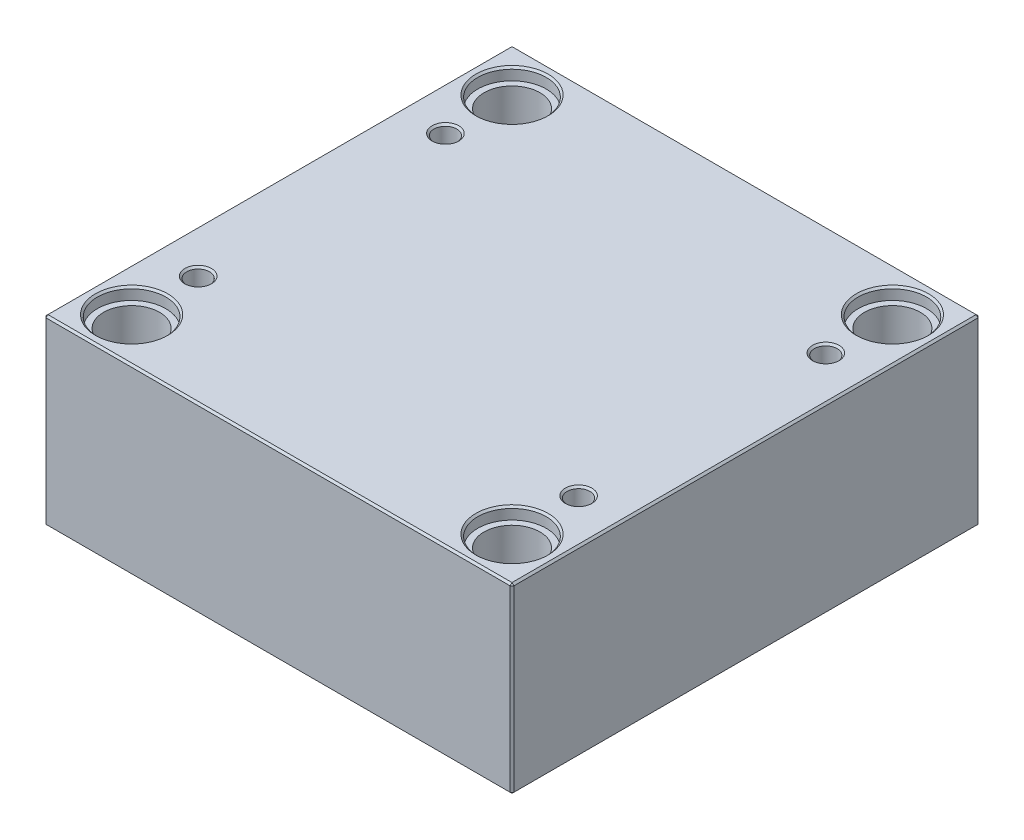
ISO-10303-21;
HEADER;
FILE_DESCRIPTION(('STEP AP214'),'2;1');
FILE_NAME('part.step','',(''),(''),'','','');
FILE_SCHEMA(('AUTOMOTIVE_DESIGN { 1 0 10303 214 1 1 1 1 }'));
ENDSEC;
DATA;
#1=APPLICATION_CONTEXT('core data for automotive mechanical design processes');
#2=APPLICATION_PROTOCOL_DEFINITION('international standard','automotive_design',2000,#1);
#3=PRODUCT_CONTEXT('',#1,'mechanical');
#4=PRODUCT('Part','Part','',(#3));
#5=PRODUCT_RELATED_PRODUCT_CATEGORY('part','',(#4));
#6=PRODUCT_DEFINITION_FORMATION('','',#4);
#7=PRODUCT_DEFINITION_CONTEXT('part definition',#1,'design');
#8=PRODUCT_DEFINITION('design','',#6,#7);
#9=PRODUCT_DEFINITION_SHAPE('','',#8);
#10=(LENGTH_UNIT() NAMED_UNIT(*) SI_UNIT(.MILLI.,.METRE.));
#11=(NAMED_UNIT(*) PLANE_ANGLE_UNIT() SI_UNIT($,.RADIAN.));
#12=(NAMED_UNIT(*) SI_UNIT($,.STERADIAN.) SOLID_ANGLE_UNIT());
#13=UNCERTAINTY_MEASURE_WITH_UNIT(LENGTH_MEASURE(1.E-05),#10,'distance_accuracy_value','');
#14=(GEOMETRIC_REPRESENTATION_CONTEXT(3) GLOBAL_UNCERTAINTY_ASSIGNED_CONTEXT((#13)) GLOBAL_UNIT_ASSIGNED_CONTEXT((#10,
#11,#12)) REPRESENTATION_CONTEXT('',''));
#15=CARTESIAN_POINT('',(0.,0.,0.));
#16=DIRECTION('',(0.,0.,1.));
#17=DIRECTION('',(1.,0.,0.));
#18=AXIS2_PLACEMENT_3D('',#15,#16,#17);
#19=CARTESIAN_POINT('',(-100.,0.,-100.));
#20=DIRECTION('',(0.,1.,0.));
#21=DIRECTION('',(0.,0.,1.));
#22=AXIS2_PLACEMENT_3D('',#19,#20,#21);
#23=CYLINDRICAL_SURFACE('',#22,14.7);
#24=CARTESIAN_POINT('',(-100.,0.999999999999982,-100.));
#25=DIRECTION('',(0.,1.,0.));
#26=DIRECTION('',(0.,0.,1.));
#27=AXIS2_PLACEMENT_3D('',#24,#25,#26);
#28=CIRCLE('',#27,14.7);
#29=CARTESIAN_POINT('',(-100.,0.999999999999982,-85.3));
#30=VERTEX_POINT('',#29);
#31=EDGE_CURVE('E472',#30,#30,#28,.F.);
#32=ORIENTED_EDGE('',*,*,#31,.T.);
#33=EDGE_LOOP('',(#32));
#34=FACE_BOUND('',#33,.T.);
#35=CARTESIAN_POINT('',(-100.,89.7,-100.));
#36=DIRECTION('',(0.,1.,0.));
#37=DIRECTION('',(0.,0.,1.));
#38=AXIS2_PLACEMENT_3D('',#35,#36,#37);
#39=CIRCLE('',#38,14.7);
#40=CARTESIAN_POINT('',(-100.,89.7,-85.3));
#41=VERTEX_POINT('',#40);
#42=EDGE_CURVE('E221',#41,#41,#39,.F.);
#43=ORIENTED_EDGE('',*,*,#42,.F.);
#44=EDGE_LOOP('',(#43));
#45=FACE_BOUND('',#44,.T.);
#46=ADVANCED_FACE('F16',(#34,#45),#23,.F.);
#47=CARTESIAN_POINT('',(100.,0.,-100.));
#48=DIRECTION('',(0.,1.,0.));
#49=DIRECTION('',(0.,0.,1.));
#50=AXIS2_PLACEMENT_3D('',#47,#48,#49);
#51=CYLINDRICAL_SURFACE('',#50,14.7);
#52=CARTESIAN_POINT('',(100.,0.999999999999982,-100.));
#53=DIRECTION('',(0.,1.,0.));
#54=DIRECTION('',(0.,0.,1.));
#55=AXIS2_PLACEMENT_3D('',#52,#53,#54);
#56=CIRCLE('',#55,14.7);
#57=CARTESIAN_POINT('',(100.,0.999999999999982,-85.3));
#58=VERTEX_POINT('',#57);
#59=EDGE_CURVE('E474',#58,#58,#56,.F.);
#60=ORIENTED_EDGE('',*,*,#59,.T.);
#61=EDGE_LOOP('',(#60));
#62=FACE_BOUND('',#61,.T.);
#63=CARTESIAN_POINT('',(100.,89.7,-100.));
#64=DIRECTION('',(0.,1.,0.));
#65=DIRECTION('',(0.,0.,1.));
#66=AXIS2_PLACEMENT_3D('',#63,#64,#65);
#67=CIRCLE('',#66,14.7);
#68=CARTESIAN_POINT('',(100.,89.7,-85.3));
#69=VERTEX_POINT('',#68);
#70=EDGE_CURVE('E218',#69,#69,#67,.F.);
#71=ORIENTED_EDGE('',*,*,#70,.F.);
#72=EDGE_LOOP('',(#71));
#73=FACE_BOUND('',#72,.T.);
#74=ADVANCED_FACE('F263',(#62,#73),#51,.F.);
#75=CARTESIAN_POINT('',(100.,0.,100.));
#76=DIRECTION('',(0.,1.,0.));
#77=DIRECTION('',(0.,0.,1.));
#78=AXIS2_PLACEMENT_3D('',#75,#76,#77);
#79=CYLINDRICAL_SURFACE('',#78,14.7);
#80=CARTESIAN_POINT('',(100.,1.00000000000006,100.));
#81=DIRECTION('',(0.,1.,0.));
#82=DIRECTION('',(0.,0.,1.));
#83=AXIS2_PLACEMENT_3D('',#80,#81,#82);
#84=CIRCLE('',#83,14.7);
#85=CARTESIAN_POINT('',(100.,1.00000000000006,114.7));
#86=VERTEX_POINT('',#85);
#87=EDGE_CURVE('E477',#86,#86,#84,.F.);
#88=ORIENTED_EDGE('',*,*,#87,.T.);
#89=EDGE_LOOP('',(#88));
#90=FACE_BOUND('',#89,.T.);
#91=CARTESIAN_POINT('',(100.,89.7,100.));
#92=DIRECTION('',(0.,1.,0.));
#93=DIRECTION('',(0.,0.,1.));
#94=AXIS2_PLACEMENT_3D('',#91,#92,#93);
#95=CIRCLE('',#94,14.7);
#96=CARTESIAN_POINT('',(100.,89.7,114.7));
#97=VERTEX_POINT('',#96);
#98=EDGE_CURVE('E214',#97,#97,#95,.F.);
#99=ORIENTED_EDGE('',*,*,#98,.F.);
#100=EDGE_LOOP('',(#99));
#101=FACE_BOUND('',#100,.T.);
#102=ADVANCED_FACE('F270',(#90,#101),#79,.F.);
#103=CARTESIAN_POINT('',(-100.,0.,100.));
#104=DIRECTION('',(0.,1.,0.));
#105=DIRECTION('',(0.,0.,1.));
#106=AXIS2_PLACEMENT_3D('',#103,#104,#105);
#107=CYLINDRICAL_SURFACE('',#106,14.7);
#108=CARTESIAN_POINT('',(-100.,1.00000000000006,100.));
#109=DIRECTION('',(0.,1.,0.));
#110=DIRECTION('',(0.,0.,1.));
#111=AXIS2_PLACEMENT_3D('',#108,#109,#110);
#112=CIRCLE('',#111,14.7);
#113=CARTESIAN_POINT('',(-100.,1.00000000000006,114.7));
#114=VERTEX_POINT('',#113);
#115=EDGE_CURVE('E480',#114,#114,#112,.F.);
#116=ORIENTED_EDGE('',*,*,#115,.T.);
#117=EDGE_LOOP('',(#116));
#118=FACE_BOUND('',#117,.T.);
#119=CARTESIAN_POINT('',(-100.,89.7,100.));
#120=DIRECTION('',(0.,1.,0.));
#121=DIRECTION('',(0.,0.,1.));
#122=AXIS2_PLACEMENT_3D('',#119,#120,#121);
#123=CIRCLE('',#122,14.7);
#124=CARTESIAN_POINT('',(-100.,89.7,114.7));
#125=VERTEX_POINT('',#124);
#126=EDGE_CURVE('E211',#125,#125,#123,.F.);
#127=ORIENTED_EDGE('',*,*,#126,.F.);
#128=EDGE_LOOP('',(#127));
#129=FACE_BOUND('',#128,.T.);
#130=ADVANCED_FACE('F277',(#118,#129),#107,.F.);
#131=CARTESIAN_POINT('',(-123.,96.,123.));
#132=DIRECTION('',(1.,0.,0.));
#133=DIRECTION('',(0.,0.,-1.));
#134=AXIS2_PLACEMENT_3D('',#131,#132,#133);
#135=PLANE('',#134);
#136=DIRECTION('',(0.,-1.,0.));
#137=VECTOR('',#136,1.);
#138=CARTESIAN_POINT('',(-123.,96.,-122.));
#139=LINE('',#138,#137);
#140=CARTESIAN_POINT('',(-123.,95.,-122.));
#141=VERTEX_POINT('',#140);
#142=CARTESIAN_POINT('',(-123.,1.,-122.));
#143=VERTEX_POINT('',#142);
#144=EDGE_CURVE('E487',#141,#143,#139,.T.);
#145=ORIENTED_EDGE('',*,*,#144,.T.);
#146=DIRECTION('',(0.,0.,1.));
#147=VECTOR('',#146,1.);
#148=CARTESIAN_POINT('',(-123.,1.,123.));
#149=LINE('',#148,#147);
#150=CARTESIAN_POINT('',(-123.,1.,122.));
#151=VERTEX_POINT('',#150);
#152=EDGE_CURVE('E490',#143,#151,#149,.T.);
#153=ORIENTED_EDGE('',*,*,#152,.T.);
#154=DIRECTION('',(0.,1.,0.));
#155=VECTOR('',#154,1.);
#156=CARTESIAN_POINT('',(-123.,96.,122.));
#157=LINE('',#156,#155);
#158=CARTESIAN_POINT('',(-123.,95.,122.));
#159=VERTEX_POINT('',#158);
#160=EDGE_CURVE('E485',#151,#159,#157,.T.);
#161=ORIENTED_EDGE('',*,*,#160,.T.);
#162=DIRECTION('',(0.,0.,-1.));
#163=VECTOR('',#162,1.);
#164=CARTESIAN_POINT('',(-123.,95.,-123.));
#165=LINE('',#164,#163);
#166=EDGE_CURVE('E483',#159,#141,#165,.T.);
#167=ORIENTED_EDGE('',*,*,#166,.T.);
#168=EDGE_LOOP('',(#145,#153,#161,#167));
#169=FACE_BOUND('',#168,.T.);
#170=ADVANCED_FACE('F298',(#169),#135,.F.);
#171=CARTESIAN_POINT('',(123.,96.,123.));
#172=DIRECTION('',(0.,0.,-1.));
#173=DIRECTION('',(-1.,0.,0.));
#174=AXIS2_PLACEMENT_3D('',#171,#172,#173);
#175=PLANE('',#174);
#176=DIRECTION('',(-1.,0.,0.));
#177=VECTOR('',#176,1.);
#178=CARTESIAN_POINT('',(-123.,95.,123.));
#179=LINE('',#178,#177);
#180=CARTESIAN_POINT('',(122.,95.,123.));
#181=VERTEX_POINT('',#180);
#182=CARTESIAN_POINT('',(-122.,95.,123.));
#183=VERTEX_POINT('',#182);
#184=EDGE_CURVE('E509',#181,#183,#179,.T.);
#185=ORIENTED_EDGE('',*,*,#184,.T.);
#186=DIRECTION('',(0.,-1.,0.));
#187=VECTOR('',#186,1.);
#188=CARTESIAN_POINT('',(-122.,96.,123.));
#189=LINE('',#188,#187);
#190=CARTESIAN_POINT('',(-122.,1.,123.));
#191=VERTEX_POINT('',#190);
#192=EDGE_CURVE('E515',#183,#191,#189,.T.);
#193=ORIENTED_EDGE('',*,*,#192,.T.);
#194=DIRECTION('',(1.,0.,0.));
#195=VECTOR('',#194,1.);
#196=CARTESIAN_POINT('',(123.,1.,123.));
#197=LINE('',#196,#195);
#198=CARTESIAN_POINT('',(122.,1.,123.));
#199=VERTEX_POINT('',#198);
#200=EDGE_CURVE('E513',#191,#199,#197,.T.);
#201=ORIENTED_EDGE('',*,*,#200,.T.);
#202=DIRECTION('',(0.,1.,0.));
#203=VECTOR('',#202,1.);
#204=CARTESIAN_POINT('',(122.,96.,123.));
#205=LINE('',#204,#203);
#206=EDGE_CURVE('E511',#199,#181,#205,.T.);
#207=ORIENTED_EDGE('',*,*,#206,.T.);
#208=EDGE_LOOP('',(#185,#193,#201,#207));
#209=FACE_BOUND('',#208,.T.);
#210=ADVANCED_FACE('F294',(#209),#175,.F.);
#211=CARTESIAN_POINT('',(123.,96.,123.));
#212=DIRECTION('',(-1.,0.,0.));
#213=DIRECTION('',(0.,0.,1.));
#214=AXIS2_PLACEMENT_3D('',#211,#212,#213);
#215=PLANE('',#214);
#216=DIRECTION('',(0.,0.,-1.));
#217=VECTOR('',#216,1.);
#218=CARTESIAN_POINT('',(123.,1.,123.));
#219=LINE('',#218,#217);
#220=CARTESIAN_POINT('',(123.,1.,122.));
#221=VERTEX_POINT('',#220);
#222=CARTESIAN_POINT('',(123.,1.,-122.));
#223=VERTEX_POINT('',#222);
#224=EDGE_CURVE('E504',#221,#223,#219,.T.);
#225=ORIENTED_EDGE('',*,*,#224,.T.);
#226=DIRECTION('',(0.,1.,0.));
#227=VECTOR('',#226,1.);
#228=CARTESIAN_POINT('',(123.,96.,-122.));
#229=LINE('',#228,#227);
#230=CARTESIAN_POINT('',(123.,95.,-122.));
#231=VERTEX_POINT('',#230);
#232=EDGE_CURVE('E506',#223,#231,#229,.T.);
#233=ORIENTED_EDGE('',*,*,#232,.T.);
#234=DIRECTION('',(0.,0.,1.));
#235=VECTOR('',#234,1.);
#236=CARTESIAN_POINT('',(123.,95.,123.));
#237=LINE('',#236,#235);
#238=CARTESIAN_POINT('',(123.,95.,122.));
#239=VERTEX_POINT('',#238);
#240=EDGE_CURVE('E500',#231,#239,#237,.T.);
#241=ORIENTED_EDGE('',*,*,#240,.T.);
#242=DIRECTION('',(0.,-1.,0.));
#243=VECTOR('',#242,1.);
#244=CARTESIAN_POINT('',(123.,96.,122.));
#245=LINE('',#244,#243);
#246=EDGE_CURVE('E502',#239,#221,#245,.T.);
#247=ORIENTED_EDGE('',*,*,#246,.T.);
#248=EDGE_LOOP('',(#225,#233,#241,#247));
#249=FACE_BOUND('',#248,.T.);
#250=ADVANCED_FACE('F290',(#249),#215,.F.);
#251=CARTESIAN_POINT('',(123.,96.,-123.));
#252=DIRECTION('',(0.,0.,1.));
#253=DIRECTION('',(1.,0.,0.));
#254=AXIS2_PLACEMENT_3D('',#251,#252,#253);
#255=PLANE('',#254);
#256=DIRECTION('',(0.,-1.,0.));
#257=VECTOR('',#256,1.);
#258=CARTESIAN_POINT('',(122.,96.,-123.));
#259=LINE('',#258,#257);
#260=CARTESIAN_POINT('',(122.,95.,-123.));
#261=VERTEX_POINT('',#260);
#262=CARTESIAN_POINT('',(122.,1.,-123.));
#263=VERTEX_POINT('',#262);
#264=EDGE_CURVE('E494',#261,#263,#259,.T.);
#265=ORIENTED_EDGE('',*,*,#264,.T.);
#266=DIRECTION('',(-1.,0.,0.));
#267=VECTOR('',#266,1.);
#268=CARTESIAN_POINT('',(123.,1.,-123.));
#269=LINE('',#268,#267);
#270=CARTESIAN_POINT('',(-122.,1.,-123.));
#271=VERTEX_POINT('',#270);
#272=EDGE_CURVE('E138',#263,#271,#269,.T.);
#273=ORIENTED_EDGE('',*,*,#272,.T.);
#274=DIRECTION('',(0.,1.,0.));
#275=VECTOR('',#274,1.);
#276=CARTESIAN_POINT('',(-122.,96.,-123.));
#277=LINE('',#276,#275);
#278=CARTESIAN_POINT('',(-122.,95.,-123.));
#279=VERTEX_POINT('',#278);
#280=EDGE_CURVE('E496',#271,#279,#277,.T.);
#281=ORIENTED_EDGE('',*,*,#280,.T.);
#282=DIRECTION('',(1.,0.,0.));
#283=VECTOR('',#282,1.);
#284=CARTESIAN_POINT('',(123.,95.,-123.));
#285=LINE('',#284,#283);
#286=EDGE_CURVE('E492',#279,#261,#285,.T.);
#287=ORIENTED_EDGE('',*,*,#286,.T.);
#288=EDGE_LOOP('',(#265,#273,#281,#287));
#289=FACE_BOUND('',#288,.T.);
#290=ADVANCED_FACE('F282',(#289),#255,.F.);
#291=CARTESIAN_POINT('',(0.,96.,0.));
#292=DIRECTION('',(0.,1.,0.));
#293=DIRECTION('',(0.,0.,1.));
#294=AXIS2_PLACEMENT_3D('',#291,#292,#293);
#295=PLANE('',#294);
#296=CARTESIAN_POINT('',(100.,96.,100.));
#297=DIRECTION('',(0.,1.,0.));
#298=DIRECTION('',(0.,0.,1.));
#299=AXIS2_PLACEMENT_3D('',#296,#297,#298);
#300=CIRCLE('',#299,19.);
#301=CARTESIAN_POINT('',(100.,96.,119.));
#302=VERTEX_POINT('',#301);
#303=EDGE_CURVE('E236',#302,#302,#300,.F.);
#304=ORIENTED_EDGE('',*,*,#303,.T.);
#305=EDGE_LOOP('',(#304));
#306=FACE_BOUND('',#305,.T.);
#307=CARTESIAN_POINT('',(-100.,96.,100.));
#308=DIRECTION('',(0.,1.,0.));
#309=DIRECTION('',(0.,0.,1.));
#310=AXIS2_PLACEMENT_3D('',#307,#308,#309);
#311=CIRCLE('',#310,19.);
#312=CARTESIAN_POINT('',(-100.,96.,119.));
#313=VERTEX_POINT('',#312);
#314=EDGE_CURVE('E233',#313,#313,#311,.F.);
#315=ORIENTED_EDGE('',*,*,#314,.T.);
#316=EDGE_LOOP('',(#315));
#317=FACE_BOUND('',#316,.T.);
#318=CARTESIAN_POINT('',(100.,96.,-100.));
#319=DIRECTION('',(0.,1.,0.));
#320=DIRECTION('',(0.,0.,1.));
#321=AXIS2_PLACEMENT_3D('',#318,#319,#320);
#322=CIRCLE('',#321,19.);
#323=CARTESIAN_POINT('',(100.,96.,-81.));
#324=VERTEX_POINT('',#323);
#325=EDGE_CURVE('E230',#324,#324,#322,.F.);
#326=ORIENTED_EDGE('',*,*,#325,.T.);
#327=EDGE_LOOP('',(#326));
#328=FACE_BOUND('',#327,.T.);
#329=CARTESIAN_POINT('',(-100.,96.,-100.));
#330=DIRECTION('',(0.,1.,0.));
#331=DIRECTION('',(0.,0.,1.));
#332=AXIS2_PLACEMENT_3D('',#329,#330,#331);
#333=CIRCLE('',#332,19.);
#334=CARTESIAN_POINT('',(-100.,96.,-81.));
#335=VERTEX_POINT('',#334);
#336=EDGE_CURVE('E227',#335,#335,#333,.F.);
#337=ORIENTED_EDGE('',*,*,#336,.T.);
#338=EDGE_LOOP('',(#337));
#339=FACE_BOUND('',#338,.T.);
#340=CARTESIAN_POINT('',(-100.,96.,65.));
#341=DIRECTION('',(0.,1.,0.));
#342=DIRECTION('',(0.,0.,1.));
#343=AXIS2_PLACEMENT_3D('',#340,#341,#342);
#344=CIRCLE('',#343,7.);
#345=CARTESIAN_POINT('',(-100.,96.,72.));
#346=VERTEX_POINT('',#345);
#347=EDGE_CURVE('E198',#346,#346,#344,.F.);
#348=ORIENTED_EDGE('',*,*,#347,.T.);
#349=EDGE_LOOP('',(#348));
#350=FACE_BOUND('',#349,.T.);
#351=CARTESIAN_POINT('',(100.,96.,65.));
#352=DIRECTION('',(0.,1.,0.));
#353=DIRECTION('',(0.,0.,1.));
#354=AXIS2_PLACEMENT_3D('',#351,#352,#353);
#355=CIRCLE('',#354,7.);
#356=CARTESIAN_POINT('',(100.,96.,72.));
#357=VERTEX_POINT('',#356);
#358=EDGE_CURVE('E195',#357,#357,#355,.F.);
#359=ORIENTED_EDGE('',*,*,#358,.T.);
#360=EDGE_LOOP('',(#359));
#361=FACE_BOUND('',#360,.T.);
#362=CARTESIAN_POINT('',(100.,96.,-65.));
#363=DIRECTION('',(0.,1.,0.));
#364=DIRECTION('',(0.,0.,1.));
#365=AXIS2_PLACEMENT_3D('',#362,#363,#364);
#366=CIRCLE('',#365,7.);
#367=CARTESIAN_POINT('',(100.,96.,-58.));
#368=VERTEX_POINT('',#367);
#369=EDGE_CURVE('E192',#368,#368,#366,.F.);
#370=ORIENTED_EDGE('',*,*,#369,.T.);
#371=EDGE_LOOP('',(#370));
#372=FACE_BOUND('',#371,.T.);
#373=CARTESIAN_POINT('',(-100.,96.,-65.));
#374=DIRECTION('',(0.,1.,0.));
#375=DIRECTION('',(0.,0.,1.));
#376=AXIS2_PLACEMENT_3D('',#373,#374,#375);
#377=CIRCLE('',#376,7.);
#378=CARTESIAN_POINT('',(-100.,96.,-58.));
#379=VERTEX_POINT('',#378);
#380=EDGE_CURVE('E188',#379,#379,#377,.F.);
#381=ORIENTED_EDGE('',*,*,#380,.T.);
#382=EDGE_LOOP('',(#381));
#383=FACE_BOUND('',#382,.T.);
#384=DIRECTION('',(0.,0.,-1.));
#385=VECTOR('',#384,1.);
#386=CARTESIAN_POINT('',(122.,96.,-123.));
#387=LINE('',#386,#385);
#388=CARTESIAN_POINT('',(122.,96.,122.));
#389=VERTEX_POINT('',#388);
#390=CARTESIAN_POINT('',(122.,96.,-122.));
#391=VERTEX_POINT('',#390);
#392=EDGE_CURVE('E31',#389,#391,#387,.T.);
#393=ORIENTED_EDGE('',*,*,#392,.T.);
#394=DIRECTION('',(-1.,0.,0.));
#395=VECTOR('',#394,1.);
#396=CARTESIAN_POINT('',(-123.,96.,-122.));
#397=LINE('',#396,#395);
#398=CARTESIAN_POINT('',(-122.,96.,-122.));
#399=VERTEX_POINT('',#398);
#400=EDGE_CURVE('E189',#391,#399,#397,.T.);
#401=ORIENTED_EDGE('',*,*,#400,.T.);
#402=DIRECTION('',(0.,0.,1.));
#403=VECTOR('',#402,1.);
#404=CARTESIAN_POINT('',(-122.,96.,123.));
#405=LINE('',#404,#403);
#406=CARTESIAN_POINT('',(-122.,96.,122.));
#407=VERTEX_POINT('',#406);
#408=EDGE_CURVE('E518',#399,#407,#405,.T.);
#409=ORIENTED_EDGE('',*,*,#408,.T.);
#410=DIRECTION('',(1.,0.,0.));
#411=VECTOR('',#410,1.);
#412=CARTESIAN_POINT('',(123.,96.,122.));
#413=LINE('',#412,#411);
#414=EDGE_CURVE('E36',#407,#389,#413,.T.);
#415=ORIENTED_EDGE('',*,*,#414,.T.);
#416=EDGE_LOOP('',(#393,#401,#409,#415));
#417=FACE_BOUND('',#416,.T.);
#418=ADVANCED_FACE('F279',(#306,#317,#328,#339,#350,#361,#372,#383,#417),#295,.T.);
#419=CARTESIAN_POINT('',(0.,0.,0.));
#420=DIRECTION('',(0.,1.,0.));
#421=DIRECTION('',(0.,0.,1.));
#422=AXIS2_PLACEMENT_3D('',#419,#420,#421);
#423=PLANE('',#422);
#424=CARTESIAN_POINT('',(-100.,0.,-100.));
#425=DIRECTION('',(0.,1.,0.));
#426=DIRECTION('',(0.,0.,1.));
#427=AXIS2_PLACEMENT_3D('',#424,#425,#426);
#428=CIRCLE('',#427,15.7);
#429=CARTESIAN_POINT('',(-100.,0.,-84.3));
#430=VERTEX_POINT('',#429);
#431=EDGE_CURVE('E469',#430,#430,#428,.T.);
#432=ORIENTED_EDGE('',*,*,#431,.T.);
#433=EDGE_LOOP('',(#432));
#434=FACE_BOUND('',#433,.T.);
#435=CARTESIAN_POINT('',(100.,0.,-100.));
#436=DIRECTION('',(0.,1.,0.));
#437=DIRECTION('',(0.,0.,1.));
#438=AXIS2_PLACEMENT_3D('',#435,#436,#437);
#439=CIRCLE('',#438,15.7);
#440=CARTESIAN_POINT('',(100.,0.,-84.3));
#441=VERTEX_POINT('',#440);
#442=EDGE_CURVE('E466',#441,#441,#439,.T.);
#443=ORIENTED_EDGE('',*,*,#442,.T.);
#444=EDGE_LOOP('',(#443));
#445=FACE_BOUND('',#444,.T.);
#446=CARTESIAN_POINT('',(100.,0.,100.));
#447=DIRECTION('',(0.,1.,0.));
#448=DIRECTION('',(0.,0.,1.));
#449=AXIS2_PLACEMENT_3D('',#446,#447,#448);
#450=CIRCLE('',#449,15.7);
#451=CARTESIAN_POINT('',(100.,0.,115.7));
#452=VERTEX_POINT('',#451);
#453=EDGE_CURVE('E463',#452,#452,#450,.T.);
#454=ORIENTED_EDGE('',*,*,#453,.T.);
#455=EDGE_LOOP('',(#454));
#456=FACE_BOUND('',#455,.T.);
#457=CARTESIAN_POINT('',(-100.,0.,100.));
#458=DIRECTION('',(0.,1.,0.));
#459=DIRECTION('',(0.,0.,1.));
#460=AXIS2_PLACEMENT_3D('',#457,#458,#459);
#461=CIRCLE('',#460,15.7);
#462=CARTESIAN_POINT('',(-100.,0.,115.7));
#463=VERTEX_POINT('',#462);
#464=EDGE_CURVE('E460',#463,#463,#461,.T.);
#465=ORIENTED_EDGE('',*,*,#464,.T.);
#466=EDGE_LOOP('',(#465));
#467=FACE_BOUND('',#466,.T.);
#468=DIRECTION('',(0.,0.,1.));
#469=VECTOR('',#468,1.);
#470=CARTESIAN_POINT('',(122.,0.,0.));
#471=LINE('',#470,#469);
#472=CARTESIAN_POINT('',(122.,0.,-122.));
#473=VERTEX_POINT('',#472);
#474=CARTESIAN_POINT('',(122.,0.,122.));
#475=VERTEX_POINT('',#474);
#476=EDGE_CURVE('E108',#473,#475,#471,.T.);
#477=ORIENTED_EDGE('',*,*,#476,.T.);
#478=DIRECTION('',(-1.,0.,0.));
#479=VECTOR('',#478,1.);
#480=CARTESIAN_POINT('',(0.,0.,122.));
#481=LINE('',#480,#479);
#482=CARTESIAN_POINT('',(-122.,0.,122.));
#483=VERTEX_POINT('',#482);
#484=EDGE_CURVE('E458',#475,#483,#481,.T.);
#485=ORIENTED_EDGE('',*,*,#484,.T.);
#486=DIRECTION('',(0.,0.,-1.));
#487=VECTOR('',#486,1.);
#488=CARTESIAN_POINT('',(-122.,0.,0.));
#489=LINE('',#488,#487);
#490=CARTESIAN_POINT('',(-122.,0.,-122.));
#491=VERTEX_POINT('',#490);
#492=EDGE_CURVE('E110',#483,#491,#489,.T.);
#493=ORIENTED_EDGE('',*,*,#492,.T.);
#494=DIRECTION('',(1.,0.,0.));
#495=VECTOR('',#494,1.);
#496=CARTESIAN_POINT('',(0.,0.,-122.));
#497=LINE('',#496,#495);
#498=EDGE_CURVE('E104',#491,#473,#497,.T.);
#499=ORIENTED_EDGE('',*,*,#498,.T.);
#500=EDGE_LOOP('',(#477,#485,#493,#499));
#501=FACE_BOUND('',#500,.T.);
#502=ADVANCED_FACE('F106',(#434,#445,#456,#467,#501),#423,.F.);
#503=CARTESIAN_POINT('',(-100.,0.,-100.));
#504=DIRECTION('',(0.,-1.,0.));
#505=DIRECTION('',(0.,0.,-1.));
#506=AXIS2_PLACEMENT_3D('',#503,#504,#505);
#507=CONICAL_SURFACE('',#506,15.7,0.785398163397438);
#508=ORIENTED_EDGE('',*,*,#31,.F.);
#509=EDGE_LOOP('',(#508));
#510=FACE_BOUND('',#509,.T.);
#511=ORIENTED_EDGE('',*,*,#431,.F.);
#512=EDGE_LOOP('',(#511));
#513=FACE_BOUND('',#512,.T.);
#514=ADVANCED_FACE('F286',(#510,#513),#507,.F.);
#515=CARTESIAN_POINT('',(100.,0.,-100.));
#516=DIRECTION('',(0.,-1.,0.));
#517=DIRECTION('',(0.,0.,-1.));
#518=AXIS2_PLACEMENT_3D('',#515,#516,#517);
#519=CONICAL_SURFACE('',#518,15.7,0.785398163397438);
#520=ORIENTED_EDGE('',*,*,#59,.F.);
#521=EDGE_LOOP('',(#520));
#522=FACE_BOUND('',#521,.T.);
#523=ORIENTED_EDGE('',*,*,#442,.F.);
#524=EDGE_LOOP('',(#523));
#525=FACE_BOUND('',#524,.T.);
#526=ADVANCED_FACE('F305',(#522,#525),#519,.F.);
#527=CARTESIAN_POINT('',(100.,0.,100.));
#528=DIRECTION('',(0.,-1.,0.));
#529=DIRECTION('',(0.,0.,-1.));
#530=AXIS2_PLACEMENT_3D('',#527,#528,#529);
#531=CONICAL_SURFACE('',#530,15.7,0.785398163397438);
#532=ORIENTED_EDGE('',*,*,#87,.F.);
#533=EDGE_LOOP('',(#532));
#534=FACE_BOUND('',#533,.T.);
#535=ORIENTED_EDGE('',*,*,#453,.F.);
#536=EDGE_LOOP('',(#535));
#537=FACE_BOUND('',#536,.T.);
#538=ADVANCED_FACE('F309',(#534,#537),#531,.F.);
#539=CARTESIAN_POINT('',(-100.,0.,100.));
#540=DIRECTION('',(0.,-1.,0.));
#541=DIRECTION('',(0.,0.,-1.));
#542=AXIS2_PLACEMENT_3D('',#539,#540,#541);
#543=CONICAL_SURFACE('',#542,15.7,0.785398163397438);
#544=ORIENTED_EDGE('',*,*,#115,.F.);
#545=EDGE_LOOP('',(#544));
#546=FACE_BOUND('',#545,.T.);
#547=ORIENTED_EDGE('',*,*,#464,.F.);
#548=EDGE_LOOP('',(#547));
#549=FACE_BOUND('',#548,.T.);
#550=ADVANCED_FACE('F313',(#546,#549),#543,.F.);
#551=CARTESIAN_POINT('',(123.,96.,122.));
#552=DIRECTION('',(-0.707106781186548,0.,-0.707106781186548));
#553=DIRECTION('',(0.,-1.,0.));
#554=AXIS2_PLACEMENT_3D('',#551,#552,#553);
#555=PLANE('',#554);
#556=DIRECTION('',(-0.707106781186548,0.,0.707106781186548));
#557=VECTOR('',#556,1.);
#558=CARTESIAN_POINT('',(122.,95.,123.));
#559=LINE('',#558,#557);
#560=EDGE_CURVE('E126',#181,#239,#559,.F.);
#561=ORIENTED_EDGE('',*,*,#560,.F.);
#562=ORIENTED_EDGE('',*,*,#206,.F.);
#563=DIRECTION('',(0.707106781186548,0.,-0.707106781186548));
#564=VECTOR('',#563,1.);
#565=CARTESIAN_POINT('',(122.,1.,123.));
#566=LINE('',#565,#564);
#567=EDGE_CURVE('E180',#221,#199,#566,.F.);
#568=ORIENTED_EDGE('',*,*,#567,.F.);
#569=ORIENTED_EDGE('',*,*,#246,.F.);
#570=EDGE_LOOP('',(#561,#562,#568,#569));
#571=FACE_BOUND('',#570,.T.);
#572=ADVANCED_FACE('F317',(#571),#555,.F.);
#573=CARTESIAN_POINT('',(122.,95.,123.));
#574=DIRECTION('',(0.577350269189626,0.577350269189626,0.577350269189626));
#575=DIRECTION('',(0.707106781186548,0.,-0.707106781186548));
#576=AXIS2_PLACEMENT_3D('',#573,#574,#575);
#577=PLANE('',#576);
#578=DIRECTION('',(0.,-0.70710678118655,0.707106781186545));
#579=VECTOR('',#578,1.);
#580=CARTESIAN_POINT('',(122.,95.,123.));
#581=LINE('',#580,#579);
#582=EDGE_CURVE('E175',#181,#389,#581,.F.);
#583=ORIENTED_EDGE('',*,*,#582,.F.);
#584=ORIENTED_EDGE('',*,*,#560,.T.);
#585=DIRECTION('',(-0.707106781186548,0.707106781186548,0.));
#586=VECTOR('',#585,1.);
#587=CARTESIAN_POINT('',(122.5,95.5,122.));
#588=LINE('',#587,#586);
#589=EDGE_CURVE('E177',#389,#239,#588,.F.);
#590=ORIENTED_EDGE('',*,*,#589,.F.);
#591=EDGE_LOOP('',(#583,#584,#590));
#592=FACE_BOUND('',#591,.T.);
#593=ADVANCED_FACE('F385',(#592),#577,.T.);
#594=CARTESIAN_POINT('',(122.,1.,123.));
#595=DIRECTION('',(0.577350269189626,-0.577350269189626,0.577350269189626));
#596=DIRECTION('',(0.707106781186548,0.,-0.707106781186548));
#597=AXIS2_PLACEMENT_3D('',#594,#595,#596);
#598=PLANE('',#597);
#599=DIRECTION('',(-0.707106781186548,-0.707106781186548,0.));
#600=VECTOR('',#599,1.);
#601=CARTESIAN_POINT('',(122.5,0.5,122.));
#602=LINE('',#601,#600);
#603=EDGE_CURVE('E124',#221,#475,#602,.T.);
#604=ORIENTED_EDGE('',*,*,#603,.F.);
#605=ORIENTED_EDGE('',*,*,#567,.T.);
#606=DIRECTION('',(0.,0.70710678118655,0.707106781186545));
#607=VECTOR('',#606,1.);
#608=CARTESIAN_POINT('',(122.,1.,123.));
#609=LINE('',#608,#607);
#610=EDGE_CURVE('E172',#475,#199,#609,.T.);
#611=ORIENTED_EDGE('',*,*,#610,.F.);
#612=EDGE_LOOP('',(#604,#605,#611));
#613=FACE_BOUND('',#612,.T.);
#614=ADVANCED_FACE('F381',(#613),#598,.T.);
#615=CARTESIAN_POINT('',(122.,96.,0.));
#616=DIRECTION('',(0.707106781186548,0.707106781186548,0.));
#617=DIRECTION('',(0.,0.,1.));
#618=AXIS2_PLACEMENT_3D('',#615,#616,#617);
#619=PLANE('',#618);
#620=ORIENTED_EDGE('',*,*,#589,.T.);
#621=ORIENTED_EDGE('',*,*,#240,.F.);
#622=DIRECTION('',(0.707106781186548,-0.707106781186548,0.));
#623=VECTOR('',#622,1.);
#624=CARTESIAN_POINT('',(123.,95.,-122.));
#625=LINE('',#624,#623);
#626=EDGE_CURVE('E166',#391,#231,#625,.T.);
#627=ORIENTED_EDGE('',*,*,#626,.F.);
#628=ORIENTED_EDGE('',*,*,#392,.F.);
#629=EDGE_LOOP('',(#620,#621,#627,#628));
#630=FACE_BOUND('',#629,.T.);
#631=ADVANCED_FACE('F377',(#630),#619,.T.);
#632=CARTESIAN_POINT('',(0.,96.,122.));
#633=DIRECTION('',(0.,0.707106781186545,0.70710678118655));
#634=DIRECTION('',(-1.,0.,0.));
#635=AXIS2_PLACEMENT_3D('',#632,#633,#634);
#636=PLANE('',#635);
#637=ORIENTED_EDGE('',*,*,#582,.T.);
#638=ORIENTED_EDGE('',*,*,#414,.F.);
#639=DIRECTION('',(0.,0.70710678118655,-0.707106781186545));
#640=VECTOR('',#639,1.);
#641=CARTESIAN_POINT('',(-122.,95.5,122.5));
#642=LINE('',#641,#640);
#643=EDGE_CURVE('E163',#183,#407,#642,.T.);
#644=ORIENTED_EDGE('',*,*,#643,.F.);
#645=ORIENTED_EDGE('',*,*,#184,.F.);
#646=EDGE_LOOP('',(#637,#638,#644,#645));
#647=FACE_BOUND('',#646,.T.);
#648=ADVANCED_FACE('F373',(#647),#636,.T.);
#649=CARTESIAN_POINT('',(-122.,96.,123.));
#650=DIRECTION('',(0.707106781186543,0.,-0.707106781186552));
#651=DIRECTION('',(0.,-1.,0.));
#652=AXIS2_PLACEMENT_3D('',#649,#650,#651);
#653=PLANE('',#652);
#654=DIRECTION('',(0.707106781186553,0.,0.707106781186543));
#655=VECTOR('',#654,1.);
#656=CARTESIAN_POINT('',(-122.,1.,123.));
#657=LINE('',#656,#655);
#658=EDGE_CURVE('E157',#191,#151,#657,.F.);
#659=ORIENTED_EDGE('',*,*,#658,.F.);
#660=ORIENTED_EDGE('',*,*,#192,.F.);
#661=DIRECTION('',(-0.707106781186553,0.,-0.707106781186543));
#662=VECTOR('',#661,1.);
#663=CARTESIAN_POINT('',(-123.,95.,122.));
#664=LINE('',#663,#662);
#665=EDGE_CURVE('E160',#159,#183,#664,.F.);
#666=ORIENTED_EDGE('',*,*,#665,.F.);
#667=ORIENTED_EDGE('',*,*,#160,.F.);
#668=EDGE_LOOP('',(#659,#660,#666,#667));
#669=FACE_BOUND('',#668,.T.);
#670=ADVANCED_FACE('F369',(#669),#653,.F.);
#671=CARTESIAN_POINT('',(123.,1.,123.));
#672=DIRECTION('',(0.,0.707106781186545,-0.70710678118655));
#673=DIRECTION('',(1.,0.,0.));
#674=AXIS2_PLACEMENT_3D('',#671,#672,#673);
#675=PLANE('',#674);
#676=ORIENTED_EDGE('',*,*,#610,.T.);
#677=ORIENTED_EDGE('',*,*,#200,.F.);
#678=DIRECTION('',(0.,-0.70710678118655,-0.707106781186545));
#679=VECTOR('',#678,1.);
#680=CARTESIAN_POINT('',(-122.,1.,123.));
#681=LINE('',#680,#679);
#682=EDGE_CURVE('E135',#483,#191,#681,.F.);
#683=ORIENTED_EDGE('',*,*,#682,.F.);
#684=ORIENTED_EDGE('',*,*,#484,.F.);
#685=EDGE_LOOP('',(#676,#677,#683,#684));
#686=FACE_BOUND('',#685,.T.);
#687=ADVANCED_FACE('F366',(#686),#675,.F.);
#688=CARTESIAN_POINT('',(123.,1.,123.));
#689=DIRECTION('',(-0.707106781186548,0.707106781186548,0.));
#690=DIRECTION('',(0.,0.,-1.));
#691=AXIS2_PLACEMENT_3D('',#688,#689,#690);
#692=PLANE('',#691);
#693=ORIENTED_EDGE('',*,*,#603,.T.);
#694=ORIENTED_EDGE('',*,*,#476,.F.);
#695=DIRECTION('',(0.707106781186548,0.707106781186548,0.));
#696=VECTOR('',#695,1.);
#697=CARTESIAN_POINT('',(122.5,0.500000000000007,-122.));
#698=LINE('',#697,#696);
#699=EDGE_CURVE('E121',#223,#473,#698,.F.);
#700=ORIENTED_EDGE('',*,*,#699,.F.);
#701=ORIENTED_EDGE('',*,*,#224,.F.);
#702=EDGE_LOOP('',(#693,#694,#700,#701));
#703=FACE_BOUND('',#702,.T.);
#704=ADVANCED_FACE('F119',(#703),#692,.F.);
#705=CARTESIAN_POINT('',(122.,96.,-123.));
#706=DIRECTION('',(-0.707106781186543,0.,0.707106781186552));
#707=DIRECTION('',(0.,-1.,0.));
#708=AXIS2_PLACEMENT_3D('',#705,#706,#707);
#709=PLANE('',#708);
#710=DIRECTION('',(0.707106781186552,0.,0.707106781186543));
#711=VECTOR('',#710,1.);
#712=CARTESIAN_POINT('',(123.,95.,-122.));
#713=LINE('',#712,#711);
#714=EDGE_CURVE('E168',#231,#261,#713,.F.);
#715=ORIENTED_EDGE('',*,*,#714,.F.);
#716=ORIENTED_EDGE('',*,*,#232,.F.);
#717=DIRECTION('',(-0.707106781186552,0.,-0.707106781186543));
#718=VECTOR('',#717,1.);
#719=CARTESIAN_POINT('',(122.,1.,-123.));
#720=LINE('',#719,#718);
#721=EDGE_CURVE('E134',#263,#223,#720,.F.);
#722=ORIENTED_EDGE('',*,*,#721,.F.);
#723=ORIENTED_EDGE('',*,*,#264,.F.);
#724=EDGE_LOOP('',(#715,#716,#722,#723));
#725=FACE_BOUND('',#724,.T.);
#726=ADVANCED_FACE('F359',(#725),#709,.F.);
#727=CARTESIAN_POINT('',(123.,95.,-122.));
#728=DIRECTION('',(0.57735026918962,0.577350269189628,-0.577350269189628));
#729=DIRECTION('',(0.,0.707106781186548,0.707106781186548));
#730=AXIS2_PLACEMENT_3D('',#727,#728,#729);
#731=PLANE('',#730);
#732=ORIENTED_EDGE('',*,*,#626,.T.);
#733=ORIENTED_EDGE('',*,*,#714,.T.);
#734=DIRECTION('',(0.,0.707106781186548,0.707106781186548));
#735=VECTOR('',#734,1.);
#736=CARTESIAN_POINT('',(122.,95.5,-122.5));
#737=LINE('',#736,#735);
#738=EDGE_CURVE('E152',#391,#261,#737,.F.);
#739=ORIENTED_EDGE('',*,*,#738,.F.);
#740=EDGE_LOOP('',(#732,#733,#739));
#741=FACE_BOUND('',#740,.T.);
#742=ADVANCED_FACE('F355',(#741),#731,.T.);
#743=CARTESIAN_POINT('',(-123.,95.,122.));
#744=DIRECTION('',(-0.577350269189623,0.577350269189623,0.577350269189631));
#745=DIRECTION('',(0.707106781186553,0.,0.707106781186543));
#746=AXIS2_PLACEMENT_3D('',#743,#744,#745);
#747=PLANE('',#746);
#748=ORIENTED_EDGE('',*,*,#665,.T.);
#749=ORIENTED_EDGE('',*,*,#643,.T.);
#750=DIRECTION('',(-0.707106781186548,-0.707106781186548,0.));
#751=VECTOR('',#750,1.);
#752=CARTESIAN_POINT('',(-123.,95.,122.));
#753=LINE('',#752,#751);
#754=EDGE_CURVE('E143',#159,#407,#753,.F.);
#755=ORIENTED_EDGE('',*,*,#754,.F.);
#756=EDGE_LOOP('',(#748,#749,#755));
#757=FACE_BOUND('',#756,.T.);
#758=ADVANCED_FACE('F351',(#757),#747,.T.);
#759=CARTESIAN_POINT('',(-122.,1.,123.));
#760=DIRECTION('',(-0.577350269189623,-0.577350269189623,0.577350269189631));
#761=DIRECTION('',(0.707106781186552,0.,0.707106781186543));
#762=AXIS2_PLACEMENT_3D('',#759,#760,#761);
#763=PLANE('',#762);
#764=ORIENTED_EDGE('',*,*,#682,.T.);
#765=ORIENTED_EDGE('',*,*,#658,.T.);
#766=DIRECTION('',(-0.707106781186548,0.707106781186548,0.));
#767=VECTOR('',#766,1.);
#768=CARTESIAN_POINT('',(-122.5,0.499999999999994,122.));
#769=LINE('',#768,#767);
#770=EDGE_CURVE('E139',#483,#151,#769,.T.);
#771=ORIENTED_EDGE('',*,*,#770,.F.);
#772=EDGE_LOOP('',(#764,#765,#771));
#773=FACE_BOUND('',#772,.T.);
#774=ADVANCED_FACE('F348',(#773),#763,.T.);
#775=CARTESIAN_POINT('',(122.,1.,-123.));
#776=DIRECTION('',(0.57735026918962,-0.577350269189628,-0.577350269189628));
#777=DIRECTION('',(0.,0.707106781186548,-0.707106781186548));
#778=AXIS2_PLACEMENT_3D('',#775,#776,#777);
#779=PLANE('',#778);
#780=ORIENTED_EDGE('',*,*,#721,.T.);
#781=ORIENTED_EDGE('',*,*,#699,.T.);
#782=DIRECTION('',(0.,-0.707106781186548,0.707106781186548));
#783=VECTOR('',#782,1.);
#784=CARTESIAN_POINT('',(122.,1.,-123.));
#785=LINE('',#784,#783);
#786=EDGE_CURVE('E131',#263,#473,#785,.T.);
#787=ORIENTED_EDGE('',*,*,#786,.F.);
#788=EDGE_LOOP('',(#780,#781,#787));
#789=FACE_BOUND('',#788,.T.);
#790=ADVANCED_FACE('F130',(#789),#779,.T.);
#791=CARTESIAN_POINT('',(0.,96.,-122.));
#792=DIRECTION('',(0.,0.707106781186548,-0.707106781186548));
#793=DIRECTION('',(1.,0.,0.));
#794=AXIS2_PLACEMENT_3D('',#791,#792,#793);
#795=PLANE('',#794);
#796=ORIENTED_EDGE('',*,*,#738,.T.);
#797=ORIENTED_EDGE('',*,*,#286,.F.);
#798=DIRECTION('',(0.,-0.707106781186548,-0.707106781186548));
#799=VECTOR('',#798,1.);
#800=CARTESIAN_POINT('',(-122.,95.,-123.));
#801=LINE('',#800,#799);
#802=EDGE_CURVE('E140',#399,#279,#801,.T.);
#803=ORIENTED_EDGE('',*,*,#802,.F.);
#804=ORIENTED_EDGE('',*,*,#400,.F.);
#805=EDGE_LOOP('',(#796,#797,#803,#804));
#806=FACE_BOUND('',#805,.T.);
#807=ADVANCED_FACE('F341',(#806),#795,.T.);
#808=CARTESIAN_POINT('',(-122.,96.,0.));
#809=DIRECTION('',(-0.707106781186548,0.707106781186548,0.));
#810=DIRECTION('',(0.,0.,-1.));
#811=AXIS2_PLACEMENT_3D('',#808,#809,#810);
#812=PLANE('',#811);
#813=ORIENTED_EDGE('',*,*,#754,.T.);
#814=ORIENTED_EDGE('',*,*,#408,.F.);
#815=DIRECTION('',(0.707106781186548,0.707106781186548,0.));
#816=VECTOR('',#815,1.);
#817=CARTESIAN_POINT('',(-122.5,95.5,-122.));
#818=LINE('',#817,#816);
#819=EDGE_CURVE('E146',#141,#399,#818,.T.);
#820=ORIENTED_EDGE('',*,*,#819,.F.);
#821=ORIENTED_EDGE('',*,*,#166,.F.);
#822=EDGE_LOOP('',(#813,#814,#820,#821));
#823=FACE_BOUND('',#822,.T.);
#824=ADVANCED_FACE('F337',(#823),#812,.T.);
#825=CARTESIAN_POINT('',(-123.,1.,123.));
#826=DIRECTION('',(0.707106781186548,0.707106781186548,0.));
#827=DIRECTION('',(0.,0.,1.));
#828=AXIS2_PLACEMENT_3D('',#825,#826,#827);
#829=PLANE('',#828);
#830=ORIENTED_EDGE('',*,*,#770,.T.);
#831=ORIENTED_EDGE('',*,*,#152,.F.);
#832=DIRECTION('',(0.707106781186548,-0.707106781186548,0.));
#833=VECTOR('',#832,1.);
#834=CARTESIAN_POINT('',(-123.,1.,-122.));
#835=LINE('',#834,#833);
#836=EDGE_CURVE('E529',#491,#143,#835,.F.);
#837=ORIENTED_EDGE('',*,*,#836,.F.);
#838=ORIENTED_EDGE('',*,*,#492,.F.);
#839=EDGE_LOOP('',(#830,#831,#837,#838));
#840=FACE_BOUND('',#839,.T.);
#841=ADVANCED_FACE('F334',(#840),#829,.F.);
#842=CARTESIAN_POINT('',(123.,1.,-123.));
#843=DIRECTION('',(0.,0.707106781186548,0.707106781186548));
#844=DIRECTION('',(-1.,0.,0.));
#845=AXIS2_PLACEMENT_3D('',#842,#843,#844);
#846=PLANE('',#845);
#847=ORIENTED_EDGE('',*,*,#786,.T.);
#848=ORIENTED_EDGE('',*,*,#498,.F.);
#849=DIRECTION('',(0.,0.707106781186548,-0.707106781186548));
#850=VECTOR('',#849,1.);
#851=CARTESIAN_POINT('',(-122.,0.499999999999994,-122.5));
#852=LINE('',#851,#850);
#853=EDGE_CURVE('E526',#271,#491,#852,.F.);
#854=ORIENTED_EDGE('',*,*,#853,.F.);
#855=ORIENTED_EDGE('',*,*,#272,.F.);
#856=EDGE_LOOP('',(#847,#848,#854,#855));
#857=FACE_BOUND('',#856,.T.);
#858=ADVANCED_FACE('F137',(#857),#846,.F.);
#859=CARTESIAN_POINT('',(-122.,95.,-123.));
#860=DIRECTION('',(-0.577350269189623,0.577350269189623,-0.577350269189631));
#861=DIRECTION('',(-0.707106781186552,0.,0.707106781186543));
#862=AXIS2_PLACEMENT_3D('',#859,#860,#861);
#863=PLANE('',#862);
#864=ORIENTED_EDGE('',*,*,#819,.T.);
#865=ORIENTED_EDGE('',*,*,#802,.T.);
#866=DIRECTION('',(0.707106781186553,0.,-0.707106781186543));
#867=VECTOR('',#866,1.);
#868=CARTESIAN_POINT('',(-122.,95.,-123.));
#869=LINE('',#868,#867);
#870=EDGE_CURVE('E524',#141,#279,#869,.T.);
#871=ORIENTED_EDGE('',*,*,#870,.F.);
#872=EDGE_LOOP('',(#864,#865,#871));
#873=FACE_BOUND('',#872,.T.);
#874=ADVANCED_FACE('F327',(#873),#863,.T.);
#875=CARTESIAN_POINT('',(-123.,1.,-122.));
#876=DIRECTION('',(-0.577350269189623,-0.577350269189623,-0.577350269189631));
#877=DIRECTION('',(-0.707106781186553,0.,0.707106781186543));
#878=AXIS2_PLACEMENT_3D('',#875,#876,#877);
#879=PLANE('',#878);
#880=ORIENTED_EDGE('',*,*,#853,.T.);
#881=ORIENTED_EDGE('',*,*,#836,.T.);
#882=DIRECTION('',(-0.707106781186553,0.,0.707106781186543));
#883=VECTOR('',#882,1.);
#884=CARTESIAN_POINT('',(-123.,1.,-122.));
#885=LINE('',#884,#883);
#886=EDGE_CURVE('E455',#271,#143,#885,.T.);
#887=ORIENTED_EDGE('',*,*,#886,.F.);
#888=EDGE_LOOP('',(#880,#881,#887));
#889=FACE_BOUND('',#888,.T.);
#890=ADVANCED_FACE('F323',(#889),#879,.T.);
#891=CARTESIAN_POINT('',(-123.,96.,-122.));
#892=DIRECTION('',(0.707106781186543,0.,0.707106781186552));
#893=DIRECTION('',(0.,-1.,0.));
#894=AXIS2_PLACEMENT_3D('',#891,#892,#893);
#895=PLANE('',#894);
#896=ORIENTED_EDGE('',*,*,#870,.T.);
#897=ORIENTED_EDGE('',*,*,#280,.F.);
#898=ORIENTED_EDGE('',*,*,#886,.T.);
#899=ORIENTED_EDGE('',*,*,#144,.F.);
#900=EDGE_LOOP('',(#896,#897,#898,#899));
#901=FACE_BOUND('',#900,.T.);
#902=ADVANCED_FACE('F319',(#901),#895,.F.);
#903=CARTESIAN_POINT('',(-100.,72.,-65.));
#904=DIRECTION('',(0.,1.,0.));
#905=DIRECTION('',(0.,0.,1.));
#906=AXIS2_PLACEMENT_3D('',#903,#904,#905);
#907=CYLINDRICAL_SURFACE('',#906,6.);
#908=CARTESIAN_POINT('',(-100.,95.,-65.));
#909=DIRECTION('',(0.,1.,0.));
#910=DIRECTION('',(0.,0.,1.));
#911=AXIS2_PLACEMENT_3D('',#908,#909,#910);
#912=CIRCLE('',#911,6.);
#913=CARTESIAN_POINT('',(-100.,95.,-59.));
#914=VERTEX_POINT('',#913);
#915=EDGE_CURVE('E207',#914,#914,#912,.T.);
#916=ORIENTED_EDGE('',*,*,#915,.T.);
#917=EDGE_LOOP('',(#916));
#918=FACE_BOUND('',#917,.T.);
#919=CARTESIAN_POINT('',(-100.,72.,-65.));
#920=DIRECTION('',(0.,1.,0.));
#921=DIRECTION('',(0.,0.,1.));
#922=AXIS2_PLACEMENT_3D('',#919,#920,#921);
#923=CIRCLE('',#922,6.);
#924=CARTESIAN_POINT('',(-100.,72.,-59.));
#925=VERTEX_POINT('',#924);
#926=EDGE_CURVE('E448',#925,#925,#923,.T.);
#927=ORIENTED_EDGE('',*,*,#926,.F.);
#928=EDGE_LOOP('',(#927));
#929=FACE_BOUND('',#928,.T.);
#930=ADVANCED_FACE('F322',(#918,#929),#907,.F.);
#931=CARTESIAN_POINT('',(-100.,72.,-65.));
#932=DIRECTION('',(0.,1.,0.));
#933=DIRECTION('',(0.,0.,1.));
#934=AXIS2_PLACEMENT_3D('',#931,#932,#933);
#935=PLANE('',#934);
#936=ORIENTED_EDGE('',*,*,#926,.T.);
#937=EDGE_LOOP('',(#936));
#938=FACE_BOUND('',#937,.T.);
#939=ADVANCED_FACE('F596',(#938),#935,.T.);
#940=CARTESIAN_POINT('',(100.,72.,-65.));
#941=DIRECTION('',(0.,1.,0.));
#942=DIRECTION('',(0.,0.,1.));
#943=AXIS2_PLACEMENT_3D('',#940,#941,#942);
#944=CYLINDRICAL_SURFACE('',#943,6.);
#945=CARTESIAN_POINT('',(100.,95.,-65.));
#946=DIRECTION('',(0.,1.,0.));
#947=DIRECTION('',(0.,0.,1.));
#948=AXIS2_PLACEMENT_3D('',#945,#946,#947);
#949=CIRCLE('',#948,6.);
#950=CARTESIAN_POINT('',(100.,95.,-59.));
#951=VERTEX_POINT('',#950);
#952=EDGE_CURVE('E204',#951,#951,#949,.T.);
#953=ORIENTED_EDGE('',*,*,#952,.T.);
#954=EDGE_LOOP('',(#953));
#955=FACE_BOUND('',#954,.T.);
#956=CARTESIAN_POINT('',(100.,72.,-65.));
#957=DIRECTION('',(0.,1.,0.));
#958=DIRECTION('',(0.,0.,1.));
#959=AXIS2_PLACEMENT_3D('',#956,#957,#958);
#960=CIRCLE('',#959,6.);
#961=CARTESIAN_POINT('',(100.,72.,-59.));
#962=VERTEX_POINT('',#961);
#963=EDGE_CURVE('E445',#962,#962,#960,.T.);
#964=ORIENTED_EDGE('',*,*,#963,.F.);
#965=EDGE_LOOP('',(#964));
#966=FACE_BOUND('',#965,.T.);
#967=ADVANCED_FACE('F592',(#955,#966),#944,.F.);
#968=CARTESIAN_POINT('',(100.,72.,-65.));
#969=DIRECTION('',(0.,1.,0.));
#970=DIRECTION('',(0.,0.,1.));
#971=AXIS2_PLACEMENT_3D('',#968,#969,#970);
#972=PLANE('',#971);
#973=ORIENTED_EDGE('',*,*,#963,.T.);
#974=EDGE_LOOP('',(#973));
#975=FACE_BOUND('',#974,.T.);
#976=ADVANCED_FACE('F588',(#975),#972,.T.);
#977=CARTESIAN_POINT('',(100.,72.,65.));
#978=DIRECTION('',(0.,1.,0.));
#979=DIRECTION('',(0.,0.,1.));
#980=AXIS2_PLACEMENT_3D('',#977,#978,#979);
#981=CYLINDRICAL_SURFACE('',#980,6.);
#982=CARTESIAN_POINT('',(100.,95.,65.));
#983=DIRECTION('',(0.,1.,0.));
#984=DIRECTION('',(0.,0.,1.));
#985=AXIS2_PLACEMENT_3D('',#982,#983,#984);
#986=CIRCLE('',#985,6.);
#987=CARTESIAN_POINT('',(100.,95.,71.));
#988=VERTEX_POINT('',#987);
#989=EDGE_CURVE('E201',#988,#988,#986,.T.);
#990=ORIENTED_EDGE('',*,*,#989,.T.);
#991=EDGE_LOOP('',(#990));
#992=FACE_BOUND('',#991,.T.);
#993=CARTESIAN_POINT('',(100.,72.,65.));
#994=DIRECTION('',(0.,1.,0.));
#995=DIRECTION('',(0.,0.,1.));
#996=AXIS2_PLACEMENT_3D('',#993,#994,#995);
#997=CIRCLE('',#996,6.);
#998=CARTESIAN_POINT('',(100.,72.,71.));
#999=VERTEX_POINT('',#998);
#1000=EDGE_CURVE('E449',#999,#999,#997,.T.);
#1001=ORIENTED_EDGE('',*,*,#1000,.F.);
#1002=EDGE_LOOP('',(#1001));
#1003=FACE_BOUND('',#1002,.T.);
#1004=ADVANCED_FACE('F591',(#992,#1003),#981,.F.);
#1005=CARTESIAN_POINT('',(100.,72.,65.));
#1006=DIRECTION('',(0.,1.,0.));
#1007=DIRECTION('',(0.,0.,1.));
#1008=AXIS2_PLACEMENT_3D('',#1005,#1006,#1007);
#1009=PLANE('',#1008);
#1010=ORIENTED_EDGE('',*,*,#1000,.T.);
#1011=EDGE_LOOP('',(#1010));
#1012=FACE_BOUND('',#1011,.T.);
#1013=ADVANCED_FACE('F598',(#1012),#1009,.T.);
#1014=CARTESIAN_POINT('',(-100.,72.,65.));
#1015=DIRECTION('',(0.,1.,0.));
#1016=DIRECTION('',(0.,0.,1.));
#1017=AXIS2_PLACEMENT_3D('',#1014,#1015,#1016);
#1018=CYLINDRICAL_SURFACE('',#1017,6.);
#1019=CARTESIAN_POINT('',(-100.,95.,65.));
#1020=DIRECTION('',(0.,1.,0.));
#1021=DIRECTION('',(0.,0.,1.));
#1022=AXIS2_PLACEMENT_3D('',#1019,#1020,#1021);
#1023=CIRCLE('',#1022,6.);
#1024=CARTESIAN_POINT('',(-100.,95.,71.));
#1025=VERTEX_POINT('',#1024);
#1026=EDGE_CURVE('E185',#1025,#1025,#1023,.T.);
#1027=ORIENTED_EDGE('',*,*,#1026,.T.);
#1028=EDGE_LOOP('',(#1027));
#1029=FACE_BOUND('',#1028,.T.);
#1030=CARTESIAN_POINT('',(-100.,72.,65.));
#1031=DIRECTION('',(0.,1.,0.));
#1032=DIRECTION('',(0.,0.,1.));
#1033=AXIS2_PLACEMENT_3D('',#1030,#1031,#1032);
#1034=CIRCLE('',#1033,6.);
#1035=CARTESIAN_POINT('',(-100.,72.,71.));
#1036=VERTEX_POINT('',#1035);
#1037=EDGE_CURVE('E224',#1036,#1036,#1034,.T.);
#1038=ORIENTED_EDGE('',*,*,#1037,.F.);
#1039=EDGE_LOOP('',(#1038));
#1040=FACE_BOUND('',#1039,.T.);
#1041=ADVANCED_FACE('F601',(#1029,#1040),#1018,.F.);
#1042=CARTESIAN_POINT('',(-100.,72.,65.));
#1043=DIRECTION('',(0.,1.,0.));
#1044=DIRECTION('',(0.,0.,1.));
#1045=AXIS2_PLACEMENT_3D('',#1042,#1043,#1044);
#1046=PLANE('',#1045);
#1047=ORIENTED_EDGE('',*,*,#1037,.T.);
#1048=EDGE_LOOP('',(#1047));
#1049=FACE_BOUND('',#1048,.T.);
#1050=ADVANCED_FACE('F397',(#1049),#1046,.T.);
#1051=CARTESIAN_POINT('',(-100.,95.,65.));
#1052=DIRECTION('',(0.,1.,0.));
#1053=DIRECTION('',(0.,0.,1.));
#1054=AXIS2_PLACEMENT_3D('',#1051,#1052,#1053);
#1055=CONICAL_SURFACE('',#1054,6.,0.785398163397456);
#1056=ORIENTED_EDGE('',*,*,#347,.F.);
#1057=EDGE_LOOP('',(#1056));
#1058=FACE_BOUND('',#1057,.T.);
#1059=ORIENTED_EDGE('',*,*,#1026,.F.);
#1060=EDGE_LOOP('',(#1059));
#1061=FACE_BOUND('',#1060,.T.);
#1062=ADVANCED_FACE('F393',(#1058,#1061),#1055,.F.);
#1063=CARTESIAN_POINT('',(100.,95.,65.));
#1064=DIRECTION('',(0.,1.,0.));
#1065=DIRECTION('',(0.,0.,1.));
#1066=AXIS2_PLACEMENT_3D('',#1063,#1064,#1065);
#1067=CONICAL_SURFACE('',#1066,6.,0.785398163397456);
#1068=ORIENTED_EDGE('',*,*,#358,.F.);
#1069=EDGE_LOOP('',(#1068));
#1070=FACE_BOUND('',#1069,.T.);
#1071=ORIENTED_EDGE('',*,*,#989,.F.);
#1072=EDGE_LOOP('',(#1071));
#1073=FACE_BOUND('',#1072,.T.);
#1074=ADVANCED_FACE('F396',(#1070,#1073),#1067,.F.);
#1075=CARTESIAN_POINT('',(100.,95.,-65.));
#1076=DIRECTION('',(0.,1.,0.));
#1077=DIRECTION('',(0.,0.,1.));
#1078=AXIS2_PLACEMENT_3D('',#1075,#1076,#1077);
#1079=CONICAL_SURFACE('',#1078,6.,0.785398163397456);
#1080=ORIENTED_EDGE('',*,*,#369,.F.);
#1081=EDGE_LOOP('',(#1080));
#1082=FACE_BOUND('',#1081,.T.);
#1083=ORIENTED_EDGE('',*,*,#952,.F.);
#1084=EDGE_LOOP('',(#1083));
#1085=FACE_BOUND('',#1084,.T.);
#1086=ADVANCED_FACE('F401',(#1082,#1085),#1079,.F.);
#1087=CARTESIAN_POINT('',(-100.,95.,-65.));
#1088=DIRECTION('',(0.,1.,0.));
#1089=DIRECTION('',(0.,0.,1.));
#1090=AXIS2_PLACEMENT_3D('',#1087,#1088,#1089);
#1091=CONICAL_SURFACE('',#1090,6.,0.785398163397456);
#1092=ORIENTED_EDGE('',*,*,#380,.F.);
#1093=EDGE_LOOP('',(#1092));
#1094=FACE_BOUND('',#1093,.T.);
#1095=ORIENTED_EDGE('',*,*,#915,.F.);
#1096=EDGE_LOOP('',(#1095));
#1097=FACE_BOUND('',#1096,.T.);
#1098=ADVANCED_FACE('F405',(#1094,#1097),#1091,.F.);
#1099=CARTESIAN_POINT('',(-100.,89.7,100.));
#1100=DIRECTION('',(0.,1.,0.));
#1101=DIRECTION('',(0.,0.,1.));
#1102=AXIS2_PLACEMENT_3D('',#1099,#1100,#1101);
#1103=PLANE('',#1102);
#1104=CARTESIAN_POINT('',(-100.,89.7,100.));
#1105=DIRECTION('',(0.,1.,0.));
#1106=DIRECTION('',(0.,0.,1.));
#1107=AXIS2_PLACEMENT_3D('',#1104,#1105,#1106);
#1108=CIRCLE('',#1107,18.);
#1109=CARTESIAN_POINT('',(-100.,89.7,118.));
#1110=VERTEX_POINT('',#1109);
#1111=EDGE_CURVE('E436',#1110,#1110,#1108,.T.);
#1112=ORIENTED_EDGE('',*,*,#1111,.T.);
#1113=EDGE_LOOP('',(#1112));
#1114=FACE_BOUND('',#1113,.T.);
#1115=ORIENTED_EDGE('',*,*,#126,.T.);
#1116=EDGE_LOOP('',(#1115));
#1117=FACE_BOUND('',#1116,.T.);
#1118=ADVANCED_FACE('F409',(#1114,#1117),#1103,.T.);
#1119=CARTESIAN_POINT('',(-100.,89.7,100.));
#1120=DIRECTION('',(0.,1.,0.));
#1121=DIRECTION('',(0.,0.,1.));
#1122=AXIS2_PLACEMENT_3D('',#1119,#1120,#1121);
#1123=CYLINDRICAL_SURFACE('',#1122,18.);
#1124=CARTESIAN_POINT('',(-100.,95.,100.));
#1125=DIRECTION('',(0.,1.,0.));
#1126=DIRECTION('',(0.,0.,1.));
#1127=AXIS2_PLACEMENT_3D('',#1124,#1125,#1126);
#1128=CIRCLE('',#1127,18.);
#1129=CARTESIAN_POINT('',(-100.,95.,118.));
#1130=VERTEX_POINT('',#1129);
#1131=EDGE_CURVE('E239',#1130,#1130,#1128,.T.);
#1132=ORIENTED_EDGE('',*,*,#1131,.T.);
#1133=EDGE_LOOP('',(#1132));
#1134=FACE_BOUND('',#1133,.T.);
#1135=ORIENTED_EDGE('',*,*,#1111,.F.);
#1136=EDGE_LOOP('',(#1135));
#1137=FACE_BOUND('',#1136,.T.);
#1138=ADVANCED_FACE('F574',(#1134,#1137),#1123,.F.);
#1139=CARTESIAN_POINT('',(100.,89.7,100.));
#1140=DIRECTION('',(0.,1.,0.));
#1141=DIRECTION('',(0.,0.,1.));
#1142=AXIS2_PLACEMENT_3D('',#1139,#1140,#1141);
#1143=PLANE('',#1142);
#1144=CARTESIAN_POINT('',(100.,89.7,100.));
#1145=DIRECTION('',(0.,1.,0.));
#1146=DIRECTION('',(0.,0.,1.));
#1147=AXIS2_PLACEMENT_3D('',#1144,#1145,#1146);
#1148=CIRCLE('',#1147,18.);
#1149=CARTESIAN_POINT('',(100.,89.7,118.));
#1150=VERTEX_POINT('',#1149);
#1151=EDGE_CURVE('E433',#1150,#1150,#1148,.T.);
#1152=ORIENTED_EDGE('',*,*,#1151,.T.);
#1153=EDGE_LOOP('',(#1152));
#1154=FACE_BOUND('',#1153,.T.);
#1155=ORIENTED_EDGE('',*,*,#98,.T.);
#1156=EDGE_LOOP('',(#1155));
#1157=FACE_BOUND('',#1156,.T.);
#1158=ADVANCED_FACE('F429',(#1154,#1157),#1143,.T.);
#1159=CARTESIAN_POINT('',(100.,89.7,100.));
#1160=DIRECTION('',(0.,1.,0.));
#1161=DIRECTION('',(0.,0.,1.));
#1162=AXIS2_PLACEMENT_3D('',#1159,#1160,#1161);
#1163=CYLINDRICAL_SURFACE('',#1162,18.);
#1164=CARTESIAN_POINT('',(100.,95.,100.));
#1165=DIRECTION('',(0.,1.,0.));
#1166=DIRECTION('',(0.,0.,1.));
#1167=AXIS2_PLACEMENT_3D('',#1164,#1165,#1166);
#1168=CIRCLE('',#1167,18.);
#1169=CARTESIAN_POINT('',(100.,95.,118.));
#1170=VERTEX_POINT('',#1169);
#1171=EDGE_CURVE('E210',#1170,#1170,#1168,.T.);
#1172=ORIENTED_EDGE('',*,*,#1171,.T.);
#1173=EDGE_LOOP('',(#1172));
#1174=FACE_BOUND('',#1173,.T.);
#1175=ORIENTED_EDGE('',*,*,#1151,.F.);
#1176=EDGE_LOOP('',(#1175));
#1177=FACE_BOUND('',#1176,.T.);
#1178=ADVANCED_FACE('F425',(#1174,#1177),#1163,.F.);
#1179=CARTESIAN_POINT('',(100.,89.7,-100.));
#1180=DIRECTION('',(0.,1.,0.));
#1181=DIRECTION('',(0.,0.,1.));
#1182=AXIS2_PLACEMENT_3D('',#1179,#1180,#1181);
#1183=PLANE('',#1182);
#1184=CARTESIAN_POINT('',(100.,89.7,-100.));
#1185=DIRECTION('',(0.,1.,0.));
#1186=DIRECTION('',(0.,0.,1.));
#1187=AXIS2_PLACEMENT_3D('',#1184,#1185,#1186);
#1188=CIRCLE('',#1187,18.);
#1189=CARTESIAN_POINT('',(100.,89.7,-82.));
#1190=VERTEX_POINT('',#1189);
#1191=EDGE_CURVE('E435',#1190,#1190,#1188,.T.);
#1192=ORIENTED_EDGE('',*,*,#1191,.T.);
#1193=EDGE_LOOP('',(#1192));
#1194=FACE_BOUND('',#1193,.T.);
#1195=ORIENTED_EDGE('',*,*,#70,.T.);
#1196=EDGE_LOOP('',(#1195));
#1197=FACE_BOUND('',#1196,.T.);
#1198=ADVANCED_FACE('F428',(#1194,#1197),#1183,.T.);
#1199=CARTESIAN_POINT('',(100.,89.7,-100.));
#1200=DIRECTION('',(0.,1.,0.));
#1201=DIRECTION('',(0.,0.,1.));
#1202=AXIS2_PLACEMENT_3D('',#1199,#1200,#1201);
#1203=CYLINDRICAL_SURFACE('',#1202,18.);
#1204=CARTESIAN_POINT('',(100.,95.,-100.));
#1205=DIRECTION('',(0.,1.,0.));
#1206=DIRECTION('',(0.,0.,1.));
#1207=AXIS2_PLACEMENT_3D('',#1204,#1205,#1206);
#1208=CIRCLE('',#1207,18.);
#1209=CARTESIAN_POINT('',(100.,95.,-82.));
#1210=VERTEX_POINT('',#1209);
#1211=EDGE_CURVE('E24',#1210,#1210,#1208,.T.);
#1212=ORIENTED_EDGE('',*,*,#1211,.T.);
#1213=EDGE_LOOP('',(#1212));
#1214=FACE_BOUND('',#1213,.T.);
#1215=ORIENTED_EDGE('',*,*,#1191,.F.);
#1216=EDGE_LOOP('',(#1215));
#1217=FACE_BOUND('',#1216,.T.);
#1218=ADVANCED_FACE('F244',(#1214,#1217),#1203,.F.);
#1219=CARTESIAN_POINT('',(-100.,89.7,-100.));
#1220=DIRECTION('',(0.,1.,0.));
#1221=DIRECTION('',(0.,0.,1.));
#1222=AXIS2_PLACEMENT_3D('',#1219,#1220,#1221);
#1223=PLANE('',#1222);
#1224=CARTESIAN_POINT('',(-100.,89.7,-100.));
#1225=DIRECTION('',(0.,1.,0.));
#1226=DIRECTION('',(0.,0.,1.));
#1227=AXIS2_PLACEMENT_3D('',#1224,#1225,#1226);
#1228=CIRCLE('',#1227,18.);
#1229=CARTESIAN_POINT('',(-100.,89.7,-82.));
#1230=VERTEX_POINT('',#1229);
#1231=EDGE_CURVE('E215',#1230,#1230,#1228,.T.);
#1232=ORIENTED_EDGE('',*,*,#1231,.T.);
#1233=EDGE_LOOP('',(#1232));
#1234=FACE_BOUND('',#1233,.T.);
#1235=ORIENTED_EDGE('',*,*,#42,.T.);
#1236=EDGE_LOOP('',(#1235));
#1237=FACE_BOUND('',#1236,.T.);
#1238=ADVANCED_FACE('F418',(#1234,#1237),#1223,.T.);
#1239=CARTESIAN_POINT('',(-100.,89.7,-100.));
#1240=DIRECTION('',(0.,1.,0.));
#1241=DIRECTION('',(0.,0.,1.));
#1242=AXIS2_PLACEMENT_3D('',#1239,#1240,#1241);
#1243=CYLINDRICAL_SURFACE('',#1242,18.);
#1244=CARTESIAN_POINT('',(-100.,95.,-100.));
#1245=DIRECTION('',(0.,1.,0.));
#1246=DIRECTION('',(0.,0.,1.));
#1247=AXIS2_PLACEMENT_3D('',#1244,#1245,#1246);
#1248=CIRCLE('',#1247,18.);
#1249=CARTESIAN_POINT('',(-100.,95.,-82.));
#1250=VERTEX_POINT('',#1249);
#1251=EDGE_CURVE('E10',#1250,#1250,#1248,.T.);
#1252=ORIENTED_EDGE('',*,*,#1251,.T.);
#1253=EDGE_LOOP('',(#1252));
#1254=FACE_BOUND('',#1253,.T.);
#1255=ORIENTED_EDGE('',*,*,#1231,.F.);
#1256=EDGE_LOOP('',(#1255));
#1257=FACE_BOUND('',#1256,.T.);
#1258=ADVANCED_FACE('F412',(#1254,#1257),#1243,.F.);
#1259=CARTESIAN_POINT('',(100.,95.,100.));
#1260=DIRECTION('',(0.,1.,0.));
#1261=DIRECTION('',(0.,0.,1.));
#1262=AXIS2_PLACEMENT_3D('',#1259,#1260,#1261);
#1263=CONICAL_SURFACE('',#1262,18.,0.785398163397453);
#1264=ORIENTED_EDGE('',*,*,#303,.F.);
#1265=EDGE_LOOP('',(#1264));
#1266=FACE_BOUND('',#1265,.T.);
#1267=ORIENTED_EDGE('',*,*,#1171,.F.);
#1268=EDGE_LOOP('',(#1267));
#1269=FACE_BOUND('',#1268,.T.);
#1270=ADVANCED_FACE('F258',(#1266,#1269),#1263,.F.);
#1271=CARTESIAN_POINT('',(-100.,95.,100.));
#1272=DIRECTION('',(0.,1.,0.));
#1273=DIRECTION('',(0.,0.,1.));
#1274=AXIS2_PLACEMENT_3D('',#1271,#1272,#1273);
#1275=CONICAL_SURFACE('',#1274,18.,0.785398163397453);
#1276=ORIENTED_EDGE('',*,*,#314,.F.);
#1277=EDGE_LOOP('',(#1276));
#1278=FACE_BOUND('',#1277,.T.);
#1279=ORIENTED_EDGE('',*,*,#1131,.F.);
#1280=EDGE_LOOP('',(#1279));
#1281=FACE_BOUND('',#1280,.T.);
#1282=ADVANCED_FACE('F249',(#1278,#1281),#1275,.F.);
#1283=CARTESIAN_POINT('',(100.,95.,-100.));
#1284=DIRECTION('',(0.,1.,0.));
#1285=DIRECTION('',(0.,0.,1.));
#1286=AXIS2_PLACEMENT_3D('',#1283,#1284,#1285);
#1287=CONICAL_SURFACE('',#1286,18.,0.785398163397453);
#1288=ORIENTED_EDGE('',*,*,#325,.F.);
#1289=EDGE_LOOP('',(#1288));
#1290=FACE_BOUND('',#1289,.T.);
#1291=ORIENTED_EDGE('',*,*,#1211,.F.);
#1292=EDGE_LOOP('',(#1291));
#1293=FACE_BOUND('',#1292,.T.);
#1294=ADVANCED_FACE('F247',(#1290,#1293),#1287,.F.);
#1295=CARTESIAN_POINT('',(-100.,95.,-100.));
#1296=DIRECTION('',(0.,1.,0.));
#1297=DIRECTION('',(0.,0.,1.));
#1298=AXIS2_PLACEMENT_3D('',#1295,#1296,#1297);
#1299=CONICAL_SURFACE('',#1298,18.,0.785398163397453);
#1300=ORIENTED_EDGE('',*,*,#336,.F.);
#1301=EDGE_LOOP('',(#1300));
#1302=FACE_BOUND('',#1301,.T.);
#1303=ORIENTED_EDGE('',*,*,#1251,.F.);
#1304=EDGE_LOOP('',(#1303));
#1305=FACE_BOUND('',#1304,.T.);
#1306=ADVANCED_FACE('F18',(#1302,#1305),#1299,.F.);
#1307=CLOSED_SHELL('',(#46,#74,#102,#130,#170,#210,#250,#290,#418,#502,#514,#526,#538,#550,#572,
#593,#614,#631,#648,#670,#687,#704,#726,#742,#758,#774,#790,#807,#824,#841,#858,#874,#890,#902,
#930,#939,#967,#976,#1004,#1013,#1041,#1050,#1062,#1074,#1086,#1098,#1118,#1138,#1158,#1178,
#1198,#1218,#1238,#1258,#1270,#1282,#1294,#1306));
#1308=MANIFOLD_SOLID_BREP('B1',#1307);
#1309=ADVANCED_BREP_SHAPE_REPRESENTATION('',(#18,#1308),#14);
#1310=SHAPE_DEFINITION_REPRESENTATION(#9,#1309);
ENDSEC;
END-ISO-10303-21;
